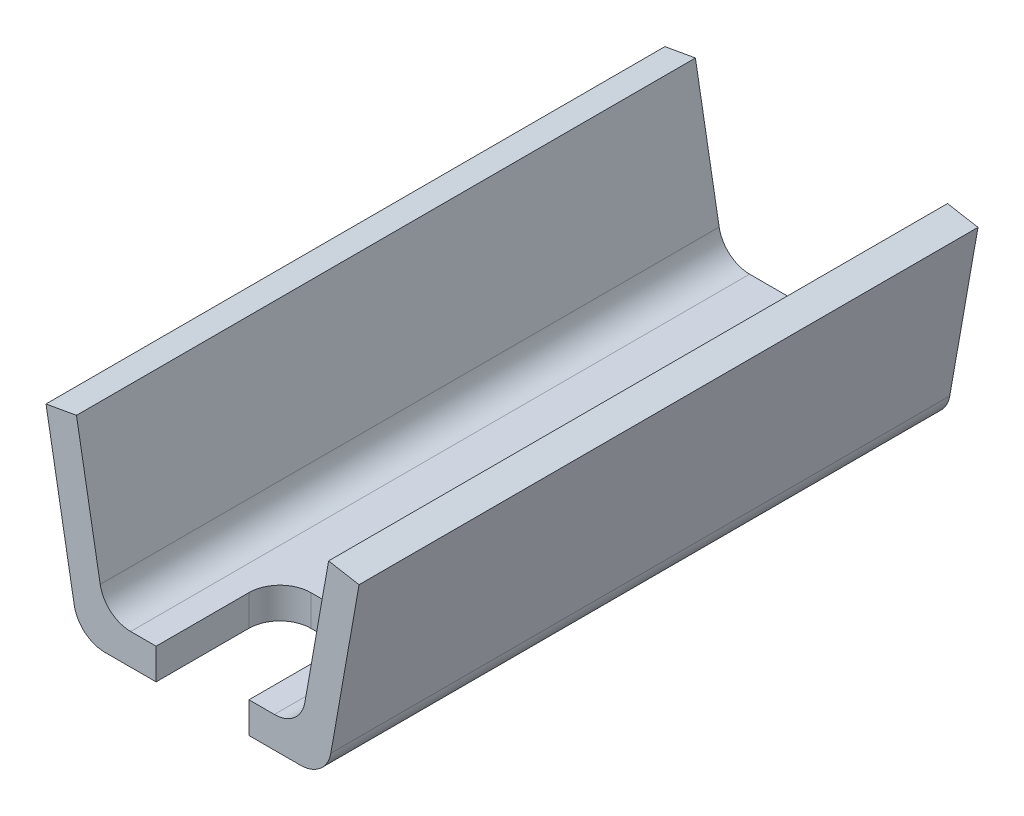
from build123d import *

# Parameters (mm, degrees)
EXTRUDE_1_DEPTH     = 100
SKETCH_2_W          = 15
SKETCH_2_H          = 11.100707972
CUT_EXTRUDE_1_DEPTH = 20
FILLET_1_R          = 5


with BuildPart() as part:
    # Sketch 1 → Extrude 1 (new body)
    with BuildSketch(Plane.XY):
        with BuildLine():
            Line((-15.804501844, 0), (15.804501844, 0))
            ThreePointArc((15.804501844, 0), (19.018439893, 1.169777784), (20.728540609, 4.131759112))
            Line((20.728540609, 4.131759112), (25.289809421, 30))
            Line((25.289809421, 30), (20.365770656, 30.868240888))
            Line((20.365770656, 30.868240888), (16.533042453, 9.131759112))
            ThreePointArc((16.533042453, 9.131759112), (14.822941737, 6.169777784), (11.609003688, 5))
            Line((11.609003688, 5), (-11.609003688, 5))
            ThreePointArc((-11.609003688, 5), (-14.822941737, 6.169777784), (-16.533042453, 9.131759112))
            Line((-16.533042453, 9.131759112), (-20.365770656, 30.868240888))
            Line((-20.365770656, 30.868240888), (-25.289809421, 30))
            Line((-25.289809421, 30), (-20.728540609, 4.131759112))
            ThreePointArc((-20.728540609, 4.131759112), (-19.018439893, 1.169777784), (-15.804501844, 0))
        make_face()
    extrude(amount=EXTRUDE_1_DEPTH)

    # Sketch 2 → Cut-Extrude 1 (cut)
    with BuildSketch(Plane.XY.offset(100)):
        with Locations((0, 1.832703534)):
            Rectangle(SKETCH_2_W, SKETCH_2_H)
    extrude(amount=-CUT_EXTRUDE_1_DEPTH, mode=Mode.SUBTRACT)

    # Fillet 1
    fillet_1_edges = [part.edges().sort_by_distance(p)[0] for p in [
        (-7.5, 2.5, 80),
        (7.5, 2.5, 80),
    ]]
    fillet(fillet_1_edges, radius=FILLET_1_R)


solid = part.part
